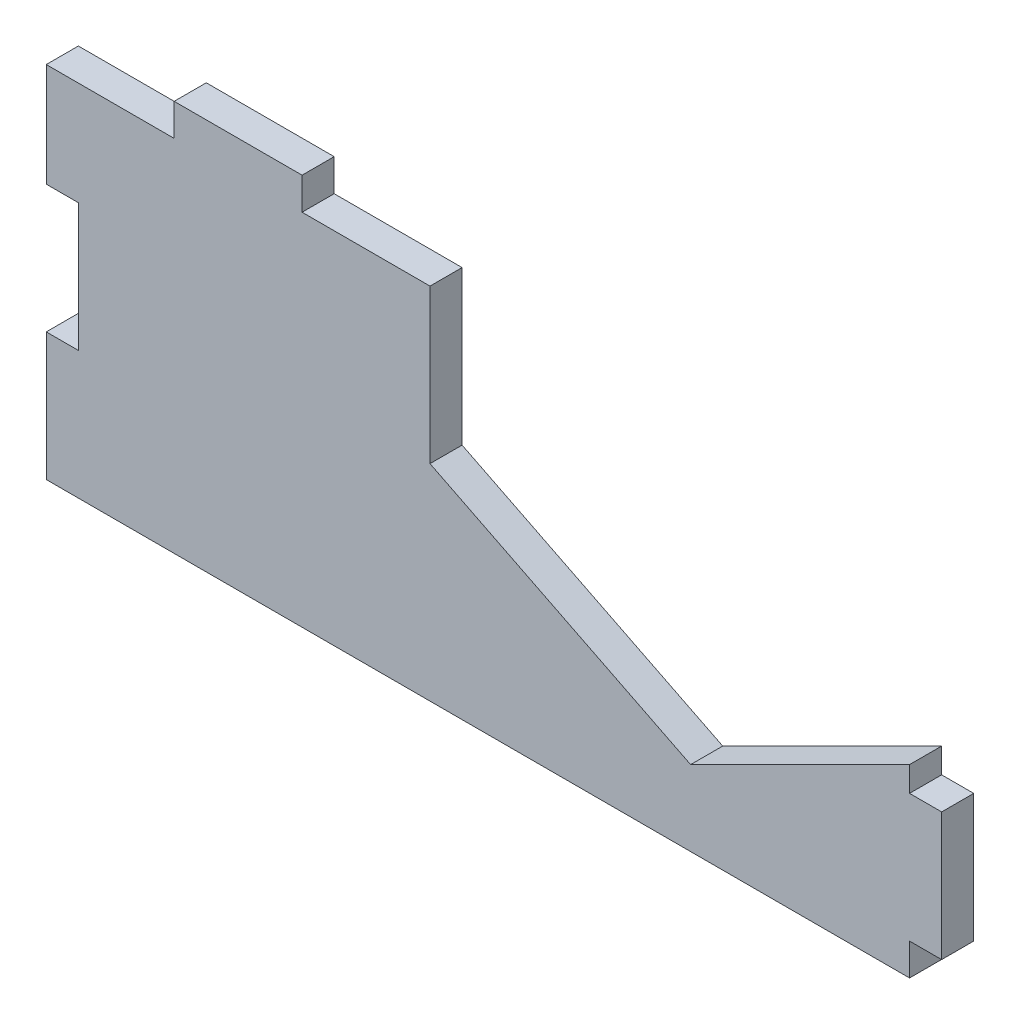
ISO-10303-21;
HEADER;
FILE_DESCRIPTION(('STEP AP214'),'2;1');
FILE_NAME('part.step','',(''),(''),'','','');
FILE_SCHEMA(('AUTOMOTIVE_DESIGN { 1 0 10303 214 1 1 1 1 }'));
ENDSEC;
DATA;
#1=APPLICATION_CONTEXT('core data for automotive mechanical design processes');
#2=APPLICATION_PROTOCOL_DEFINITION('international standard','automotive_design',2000,#1);
#3=PRODUCT_CONTEXT('',#1,'mechanical');
#4=PRODUCT('Part','Part','',(#3));
#5=PRODUCT_RELATED_PRODUCT_CATEGORY('part','',(#4));
#6=PRODUCT_DEFINITION_FORMATION('','',#4);
#7=PRODUCT_DEFINITION_CONTEXT('part definition',#1,'design');
#8=PRODUCT_DEFINITION('design','',#6,#7);
#9=PRODUCT_DEFINITION_SHAPE('','',#8);
#10=(LENGTH_UNIT() NAMED_UNIT(*) SI_UNIT(.MILLI.,.METRE.));
#11=(NAMED_UNIT(*) PLANE_ANGLE_UNIT() SI_UNIT($,.RADIAN.));
#12=(NAMED_UNIT(*) SI_UNIT($,.STERADIAN.) SOLID_ANGLE_UNIT());
#13=UNCERTAINTY_MEASURE_WITH_UNIT(LENGTH_MEASURE(1.E-05),#10,'distance_accuracy_value','');
#14=(GEOMETRIC_REPRESENTATION_CONTEXT(3) GLOBAL_UNCERTAINTY_ASSIGNED_CONTEXT((#13)) GLOBAL_UNIT_ASSIGNED_CONTEXT((#10,
#11,#12)) REPRESENTATION_CONTEXT('',''));
#15=CARTESIAN_POINT('',(0.,0.,0.));
#16=DIRECTION('',(0.,0.,1.));
#17=DIRECTION('',(1.,0.,0.));
#18=AXIS2_PLACEMENT_3D('',#15,#16,#17);
#19=CARTESIAN_POINT('',(-209.474072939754,246.209954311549,19.));
#20=DIRECTION('',(0.447213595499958,-0.894427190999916,0.));
#21=DIRECTION('',(0.894427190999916,0.447213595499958,0.));
#22=AXIS2_PLACEMENT_3D('',#19,#20,#21);
#23=PLANE('',#22);
#24=DIRECTION('',(-0.894427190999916,-0.447213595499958,0.));
#25=VECTOR('',#24,1.);
#26=CARTESIAN_POINT('',(-209.474072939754,246.209954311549,0.));
#27=LINE('',#26,#25);
#28=CARTESIAN_POINT('',(-79.8864762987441,311.003752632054,0.));
#29=VERTEX_POINT('',#28);
#30=CARTESIAN_POINT('',(-209.474072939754,246.209954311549,0.));
#31=VERTEX_POINT('',#30);
#32=EDGE_CURVE('E195',#29,#31,#27,.T.);
#33=ORIENTED_EDGE('',*,*,#32,.T.);
#34=DIRECTION('',(0.,0.,-1.));
#35=VECTOR('',#34,1.);
#36=CARTESIAN_POINT('',(-209.474072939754,246.209954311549,19.));
#37=LINE('',#36,#35);
#38=CARTESIAN_POINT('',(-209.474072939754,246.209954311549,19.));
#39=VERTEX_POINT('',#38);
#40=EDGE_CURVE('E11',#39,#31,#37,.T.);
#41=ORIENTED_EDGE('',*,*,#40,.F.);
#42=DIRECTION('',(-0.894427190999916,-0.447213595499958,0.));
#43=VECTOR('',#42,1.);
#44=CARTESIAN_POINT('',(-209.474072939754,246.209954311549,19.));
#45=LINE('',#44,#43);
#46=CARTESIAN_POINT('',(-79.8864762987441,311.003752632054,19.));
#47=VERTEX_POINT('',#46);
#48=EDGE_CURVE('E231',#47,#39,#45,.T.);
#49=ORIENTED_EDGE('',*,*,#48,.F.);
#50=DIRECTION('',(0.,0.,-1.));
#51=VECTOR('',#50,1.);
#52=CARTESIAN_POINT('',(-79.8864762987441,311.003752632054,19.));
#53=LINE('',#52,#51);
#54=EDGE_CURVE('E191',#47,#29,#53,.T.);
#55=ORIENTED_EDGE('',*,*,#54,.T.);
#56=EDGE_LOOP('',(#33,#41,#49,#55));
#57=FACE_BOUND('',#56,.T.);
#58=ADVANCED_FACE('F33',(#57),#23,.F.);
#59=CARTESIAN_POINT('',(-363.745021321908,323.345428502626,19.));
#60=DIRECTION('',(-0.447213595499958,-0.894427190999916,0.));
#61=DIRECTION('',(0.894427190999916,-0.447213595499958,0.));
#62=AXIS2_PLACEMENT_3D('',#59,#60,#61);
#63=PLANE('',#62);
#64=DIRECTION('',(-0.894427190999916,0.447213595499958,0.));
#65=VECTOR('',#64,1.);
#66=CARTESIAN_POINT('',(-363.745021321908,323.345428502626,0.));
#67=LINE('',#66,#65);
#68=CARTESIAN_POINT('',(-363.745021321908,323.345428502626,0.));
#69=VERTEX_POINT('',#68);
#70=EDGE_CURVE('E198',#31,#69,#67,.T.);
#71=ORIENTED_EDGE('',*,*,#70,.T.);
#72=DIRECTION('',(0.,0.,-1.));
#73=VECTOR('',#72,1.);
#74=CARTESIAN_POINT('',(-363.745021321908,323.345428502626,19.));
#75=LINE('',#74,#73);
#76=CARTESIAN_POINT('',(-363.745021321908,323.345428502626,19.));
#77=VERTEX_POINT('',#76);
#78=EDGE_CURVE('E41',#77,#69,#75,.T.);
#79=ORIENTED_EDGE('',*,*,#78,.F.);
#80=DIRECTION('',(-0.894427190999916,0.447213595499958,0.));
#81=VECTOR('',#80,1.);
#82=CARTESIAN_POINT('',(-363.745021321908,323.345428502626,19.));
#83=LINE('',#82,#81);
#84=EDGE_CURVE('E125',#39,#77,#83,.T.);
#85=ORIENTED_EDGE('',*,*,#84,.F.);
#86=ORIENTED_EDGE('',*,*,#40,.T.);
#87=EDGE_LOOP('',(#71,#79,#85,#86));
#88=FACE_BOUND('',#87,.T.);
#89=ADVANCED_FACE('F344',(#88),#63,.F.);
#90=CARTESIAN_POINT('',(-363.745021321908,414.365288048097,19.));
#91=DIRECTION('',(-1.,0.,0.));
#92=DIRECTION('',(0.,0.,1.));
#93=AXIS2_PLACEMENT_3D('',#90,#91,#92);
#94=PLANE('',#93);
#95=DIRECTION('',(0.,1.,0.));
#96=VECTOR('',#95,1.);
#97=CARTESIAN_POINT('',(-363.745021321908,414.365288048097,0.));
#98=LINE('',#97,#96);
#99=CARTESIAN_POINT('',(-363.745021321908,414.365288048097,0.));
#100=VERTEX_POINT('',#99);
#101=EDGE_CURVE('E200',#69,#100,#98,.T.);
#102=ORIENTED_EDGE('',*,*,#101,.T.);
#103=DIRECTION('',(0.,0.,-1.));
#104=VECTOR('',#103,1.);
#105=CARTESIAN_POINT('',(-363.745021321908,414.365288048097,19.));
#106=LINE('',#105,#104);
#107=CARTESIAN_POINT('',(-363.745021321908,414.365288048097,19.));
#108=VERTEX_POINT('',#107);
#109=EDGE_CURVE('E271',#108,#100,#106,.T.);
#110=ORIENTED_EDGE('',*,*,#109,.F.);
#111=DIRECTION('',(0.,1.,0.));
#112=VECTOR('',#111,1.);
#113=CARTESIAN_POINT('',(-363.745021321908,414.365288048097,19.));
#114=LINE('',#113,#112);
#115=EDGE_CURVE('E279',#77,#108,#114,.T.);
#116=ORIENTED_EDGE('',*,*,#115,.F.);
#117=ORIENTED_EDGE('',*,*,#78,.T.);
#118=EDGE_LOOP('',(#102,#110,#116,#117));
#119=FACE_BOUND('',#118,.T.);
#120=ADVANCED_FACE('F277',(#119),#94,.F.);
#121=CARTESIAN_POINT('',(-439.45883964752,414.365288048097,19.));
#122=DIRECTION('',(0.,-1.,0.));
#123=DIRECTION('',(0.,0.,-1.));
#124=AXIS2_PLACEMENT_3D('',#121,#122,#123);
#125=PLANE('',#124);
#126=DIRECTION('',(-1.,0.,0.));
#127=VECTOR('',#126,1.);
#128=CARTESIAN_POINT('',(-439.45883964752,414.365288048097,0.));
#129=LINE('',#128,#127);
#130=CARTESIAN_POINT('',(-439.45883964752,414.365288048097,0.));
#131=VERTEX_POINT('',#130);
#132=EDGE_CURVE('E202',#100,#131,#129,.T.);
#133=ORIENTED_EDGE('',*,*,#132,.T.);
#134=DIRECTION('',(0.,0.,-1.));
#135=VECTOR('',#134,1.);
#136=CARTESIAN_POINT('',(-439.45883964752,414.365288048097,19.));
#137=LINE('',#136,#135);
#138=CARTESIAN_POINT('',(-439.45883964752,414.365288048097,19.));
#139=VERTEX_POINT('',#138);
#140=EDGE_CURVE('E268',#139,#131,#137,.T.);
#141=ORIENTED_EDGE('',*,*,#140,.F.);
#142=DIRECTION('',(-1.,0.,0.));
#143=VECTOR('',#142,1.);
#144=CARTESIAN_POINT('',(-439.45883964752,414.365288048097,19.));
#145=LINE('',#144,#143);
#146=EDGE_CURVE('E297',#108,#139,#145,.T.);
#147=ORIENTED_EDGE('',*,*,#146,.F.);
#148=ORIENTED_EDGE('',*,*,#109,.T.);
#149=EDGE_LOOP('',(#133,#141,#147,#148));
#150=FACE_BOUND('',#149,.T.);
#151=ADVANCED_FACE('F288',(#150),#125,.F.);
#152=CARTESIAN_POINT('',(-439.45883964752,433.365288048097,19.));
#153=DIRECTION('',(-1.,0.,0.));
#154=DIRECTION('',(0.,0.,1.));
#155=AXIS2_PLACEMENT_3D('',#152,#153,#154);
#156=PLANE('',#155);
#157=DIRECTION('',(0.,1.,0.));
#158=VECTOR('',#157,1.);
#159=CARTESIAN_POINT('',(-439.45883964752,433.365288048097,0.));
#160=LINE('',#159,#158);
#161=CARTESIAN_POINT('',(-439.45883964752,433.365288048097,0.));
#162=VERTEX_POINT('',#161);
#163=EDGE_CURVE('E204',#131,#162,#160,.T.);
#164=ORIENTED_EDGE('',*,*,#163,.T.);
#165=DIRECTION('',(0.,0.,-1.));
#166=VECTOR('',#165,1.);
#167=CARTESIAN_POINT('',(-439.45883964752,433.365288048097,19.));
#168=LINE('',#167,#166);
#169=CARTESIAN_POINT('',(-439.45883964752,433.365288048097,19.));
#170=VERTEX_POINT('',#169);
#171=EDGE_CURVE('E265',#170,#162,#168,.T.);
#172=ORIENTED_EDGE('',*,*,#171,.F.);
#173=DIRECTION('',(0.,1.,0.));
#174=VECTOR('',#173,1.);
#175=CARTESIAN_POINT('',(-439.45883964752,433.365288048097,19.));
#176=LINE('',#175,#174);
#177=EDGE_CURVE('E294',#139,#170,#176,.T.);
#178=ORIENTED_EDGE('',*,*,#177,.F.);
#179=ORIENTED_EDGE('',*,*,#140,.T.);
#180=EDGE_LOOP('',(#164,#172,#178,#179));
#181=FACE_BOUND('',#180,.T.);
#182=ADVANCED_FACE('F292',(#181),#156,.F.);
#183=CARTESIAN_POINT('',(-515.172657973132,433.365288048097,19.));
#184=DIRECTION('',(0.,-1.,0.));
#185=DIRECTION('',(1.,0.,0.));
#186=AXIS2_PLACEMENT_3D('',#183,#184,#185);
#187=PLANE('',#186);
#188=DIRECTION('',(-1.,0.,0.));
#189=VECTOR('',#188,1.);
#190=CARTESIAN_POINT('',(-515.172657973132,433.365288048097,0.));
#191=LINE('',#190,#189);
#192=CARTESIAN_POINT('',(-515.172657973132,433.365288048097,0.));
#193=VERTEX_POINT('',#192);
#194=EDGE_CURVE('E206',#162,#193,#191,.T.);
#195=ORIENTED_EDGE('',*,*,#194,.T.);
#196=DIRECTION('',(0.,0.,-1.));
#197=VECTOR('',#196,1.);
#198=CARTESIAN_POINT('',(-515.172657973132,433.365288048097,19.));
#199=LINE('',#198,#197);
#200=CARTESIAN_POINT('',(-515.172657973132,433.365288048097,19.));
#201=VERTEX_POINT('',#200);
#202=EDGE_CURVE('E262',#201,#193,#199,.T.);
#203=ORIENTED_EDGE('',*,*,#202,.F.);
#204=DIRECTION('',(-1.,0.,0.));
#205=VECTOR('',#204,1.);
#206=CARTESIAN_POINT('',(-515.172657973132,433.365288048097,19.));
#207=LINE('',#206,#205);
#208=EDGE_CURVE('E296',#170,#201,#207,.T.);
#209=ORIENTED_EDGE('',*,*,#208,.F.);
#210=ORIENTED_EDGE('',*,*,#171,.T.);
#211=EDGE_LOOP('',(#195,#203,#209,#210));
#212=FACE_BOUND('',#211,.T.);
#213=ADVANCED_FACE('F357',(#212),#187,.F.);
#214=CARTESIAN_POINT('',(-515.172657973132,433.365288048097,19.));
#215=DIRECTION('',(1.,0.,0.));
#216=DIRECTION('',(0.,0.,-1.));
#217=AXIS2_PLACEMENT_3D('',#214,#215,#216);
#218=PLANE('',#217);
#219=DIRECTION('',(0.,-1.,0.));
#220=VECTOR('',#219,1.);
#221=CARTESIAN_POINT('',(-515.172657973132,433.365288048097,0.));
#222=LINE('',#221,#220);
#223=CARTESIAN_POINT('',(-515.172657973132,414.365288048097,0.));
#224=VERTEX_POINT('',#223);
#225=EDGE_CURVE('E208',#193,#224,#222,.T.);
#226=ORIENTED_EDGE('',*,*,#225,.T.);
#227=DIRECTION('',(0.,0.,-1.));
#228=VECTOR('',#227,1.);
#229=CARTESIAN_POINT('',(-515.172657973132,414.365288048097,19.));
#230=LINE('',#229,#228);
#231=CARTESIAN_POINT('',(-515.172657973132,414.365288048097,19.));
#232=VERTEX_POINT('',#231);
#233=EDGE_CURVE('E259',#232,#224,#230,.T.);
#234=ORIENTED_EDGE('',*,*,#233,.F.);
#235=DIRECTION('',(0.,-1.,0.));
#236=VECTOR('',#235,1.);
#237=CARTESIAN_POINT('',(-515.172657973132,433.365288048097,19.));
#238=LINE('',#237,#236);
#239=EDGE_CURVE('E299',#201,#232,#238,.T.);
#240=ORIENTED_EDGE('',*,*,#239,.F.);
#241=ORIENTED_EDGE('',*,*,#202,.T.);
#242=EDGE_LOOP('',(#226,#234,#240,#241));
#243=FACE_BOUND('',#242,.T.);
#244=ADVANCED_FACE('F360',(#243),#218,.F.);
#245=CARTESIAN_POINT('',(-590.886476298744,414.365288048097,19.));
#246=DIRECTION('',(0.,-1.,0.));
#247=DIRECTION('',(0.,0.,-1.));
#248=AXIS2_PLACEMENT_3D('',#245,#246,#247);
#249=PLANE('',#248);
#250=DIRECTION('',(-1.,0.,0.));
#251=VECTOR('',#250,1.);
#252=CARTESIAN_POINT('',(-590.886476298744,414.365288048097,0.));
#253=LINE('',#252,#251);
#254=CARTESIAN_POINT('',(-590.886476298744,414.365288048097,0.));
#255=VERTEX_POINT('',#254);
#256=EDGE_CURVE('E210',#224,#255,#253,.T.);
#257=ORIENTED_EDGE('',*,*,#256,.T.);
#258=DIRECTION('',(0.,0.,-1.));
#259=VECTOR('',#258,1.);
#260=CARTESIAN_POINT('',(-590.886476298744,414.365288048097,19.));
#261=LINE('',#260,#259);
#262=CARTESIAN_POINT('',(-590.886476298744,414.365288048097,19.));
#263=VERTEX_POINT('',#262);
#264=EDGE_CURVE('E256',#263,#255,#261,.T.);
#265=ORIENTED_EDGE('',*,*,#264,.F.);
#266=DIRECTION('',(-1.,0.,0.));
#267=VECTOR('',#266,1.);
#268=CARTESIAN_POINT('',(-590.886476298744,414.365288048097,19.));
#269=LINE('',#268,#267);
#270=EDGE_CURVE('E305',#232,#263,#269,.T.);
#271=ORIENTED_EDGE('',*,*,#270,.F.);
#272=ORIENTED_EDGE('',*,*,#233,.T.);
#273=EDGE_LOOP('',(#257,#265,#271,#272));
#274=FACE_BOUND('',#273,.T.);
#275=ADVANCED_FACE('F364',(#274),#249,.F.);
#276=CARTESIAN_POINT('',(-590.886476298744,414.365288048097,19.));
#277=DIRECTION('',(1.,0.,0.));
#278=DIRECTION('',(0.,0.,-1.));
#279=AXIS2_PLACEMENT_3D('',#276,#277,#278);
#280=PLANE('',#279);
#281=DIRECTION('',(0.,-1.,0.));
#282=VECTOR('',#281,1.);
#283=CARTESIAN_POINT('',(-590.886476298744,414.365288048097,0.));
#284=LINE('',#283,#282);
#285=CARTESIAN_POINT('',(-590.886476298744,353.036716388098,0.));
#286=VERTEX_POINT('',#285);
#287=EDGE_CURVE('E212',#255,#286,#284,.T.);
#288=ORIENTED_EDGE('',*,*,#287,.T.);
#289=DIRECTION('',(0.,0.,-1.));
#290=VECTOR('',#289,1.);
#291=CARTESIAN_POINT('',(-590.886476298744,353.036716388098,19.));
#292=LINE('',#291,#290);
#293=CARTESIAN_POINT('',(-590.886476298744,353.036716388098,19.));
#294=VERTEX_POINT('',#293);
#295=EDGE_CURVE('E253',#294,#286,#292,.T.);
#296=ORIENTED_EDGE('',*,*,#295,.F.);
#297=DIRECTION('',(0.,-1.,0.));
#298=VECTOR('',#297,1.);
#299=CARTESIAN_POINT('',(-590.886476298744,414.365288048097,19.));
#300=LINE('',#299,#298);
#301=EDGE_CURVE('E307',#263,#294,#300,.T.);
#302=ORIENTED_EDGE('',*,*,#301,.F.);
#303=ORIENTED_EDGE('',*,*,#264,.T.);
#304=EDGE_LOOP('',(#288,#296,#302,#303));
#305=FACE_BOUND('',#304,.T.);
#306=ADVANCED_FACE('F368',(#305),#280,.F.);
#307=CARTESIAN_POINT('',(-590.886476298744,353.036716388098,19.));
#308=DIRECTION('',(0.,1.,0.));
#309=DIRECTION('',(0.,0.,1.));
#310=AXIS2_PLACEMENT_3D('',#307,#308,#309);
#311=PLANE('',#310);
#312=DIRECTION('',(1.,0.,0.));
#313=VECTOR('',#312,1.);
#314=CARTESIAN_POINT('',(-590.886476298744,353.036716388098,0.));
#315=LINE('',#314,#313);
#316=CARTESIAN_POINT('',(-571.886476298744,353.036716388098,0.));
#317=VERTEX_POINT('',#316);
#318=EDGE_CURVE('E214',#286,#317,#315,.T.);
#319=ORIENTED_EDGE('',*,*,#318,.T.);
#320=DIRECTION('',(0.,0.,-1.));
#321=VECTOR('',#320,1.);
#322=CARTESIAN_POINT('',(-571.886476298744,353.036716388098,19.));
#323=LINE('',#322,#321);
#324=CARTESIAN_POINT('',(-571.886476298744,353.036716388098,19.));
#325=VERTEX_POINT('',#324);
#326=EDGE_CURVE('E250',#325,#317,#323,.T.);
#327=ORIENTED_EDGE('',*,*,#326,.F.);
#328=DIRECTION('',(1.,0.,0.));
#329=VECTOR('',#328,1.);
#330=CARTESIAN_POINT('',(-590.886476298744,353.036716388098,19.));
#331=LINE('',#330,#329);
#332=EDGE_CURVE('E309',#294,#325,#331,.T.);
#333=ORIENTED_EDGE('',*,*,#332,.F.);
#334=ORIENTED_EDGE('',*,*,#295,.T.);
#335=EDGE_LOOP('',(#319,#327,#333,#334));
#336=FACE_BOUND('',#335,.T.);
#337=ADVANCED_FACE('F372',(#336),#311,.F.);
#338=CARTESIAN_POINT('',(-571.886476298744,353.036716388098,19.));
#339=DIRECTION('',(1.,0.,0.));
#340=DIRECTION('',(0.,1.,0.));
#341=AXIS2_PLACEMENT_3D('',#338,#339,#340);
#342=PLANE('',#341);
#343=DIRECTION('',(0.,-1.,0.));
#344=VECTOR('',#343,1.);
#345=CARTESIAN_POINT('',(-571.886476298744,353.036716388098,0.));
#346=LINE('',#345,#344);
#347=CARTESIAN_POINT('',(-571.886476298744,277.322898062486,0.));
#348=VERTEX_POINT('',#347);
#349=EDGE_CURVE('E216',#317,#348,#346,.T.);
#350=ORIENTED_EDGE('',*,*,#349,.T.);
#351=DIRECTION('',(0.,0.,-1.));
#352=VECTOR('',#351,1.);
#353=CARTESIAN_POINT('',(-571.886476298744,277.322898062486,19.));
#354=LINE('',#353,#352);
#355=CARTESIAN_POINT('',(-571.886476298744,277.322898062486,19.));
#356=VERTEX_POINT('',#355);
#357=EDGE_CURVE('E247',#356,#348,#354,.T.);
#358=ORIENTED_EDGE('',*,*,#357,.F.);
#359=DIRECTION('',(0.,-1.,0.));
#360=VECTOR('',#359,1.);
#361=CARTESIAN_POINT('',(-571.886476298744,353.036716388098,19.));
#362=LINE('',#361,#360);
#363=EDGE_CURVE('E311',#325,#356,#362,.T.);
#364=ORIENTED_EDGE('',*,*,#363,.F.);
#365=ORIENTED_EDGE('',*,*,#326,.T.);
#366=EDGE_LOOP('',(#350,#358,#364,#365));
#367=FACE_BOUND('',#366,.T.);
#368=ADVANCED_FACE('F376',(#367),#342,.F.);
#369=CARTESIAN_POINT('',(-590.886476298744,277.322898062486,19.));
#370=DIRECTION('',(0.,-1.,0.));
#371=DIRECTION('',(0.,0.,-1.));
#372=AXIS2_PLACEMENT_3D('',#369,#370,#371);
#373=PLANE('',#372);
#374=DIRECTION('',(-1.,0.,0.));
#375=VECTOR('',#374,1.);
#376=CARTESIAN_POINT('',(-590.886476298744,277.322898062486,0.));
#377=LINE('',#376,#375);
#378=CARTESIAN_POINT('',(-590.886476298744,277.322898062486,0.));
#379=VERTEX_POINT('',#378);
#380=EDGE_CURVE('E218',#348,#379,#377,.T.);
#381=ORIENTED_EDGE('',*,*,#380,.T.);
#382=DIRECTION('',(0.,0.,-1.));
#383=VECTOR('',#382,1.);
#384=CARTESIAN_POINT('',(-590.886476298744,277.322898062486,19.));
#385=LINE('',#384,#383);
#386=CARTESIAN_POINT('',(-590.886476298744,277.322898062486,19.));
#387=VERTEX_POINT('',#386);
#388=EDGE_CURVE('E244',#387,#379,#385,.T.);
#389=ORIENTED_EDGE('',*,*,#388,.F.);
#390=DIRECTION('',(-1.,0.,0.));
#391=VECTOR('',#390,1.);
#392=CARTESIAN_POINT('',(-590.886476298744,277.322898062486,19.));
#393=LINE('',#392,#391);
#394=EDGE_CURVE('E313',#356,#387,#393,.T.);
#395=ORIENTED_EDGE('',*,*,#394,.F.);
#396=ORIENTED_EDGE('',*,*,#357,.T.);
#397=EDGE_LOOP('',(#381,#389,#395,#396));
#398=FACE_BOUND('',#397,.T.);
#399=ADVANCED_FACE('F380',(#398),#373,.F.);
#400=CARTESIAN_POINT('',(-590.886476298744,277.322898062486,19.));
#401=DIRECTION('',(1.,0.,0.));
#402=DIRECTION('',(0.,0.,-1.));
#403=AXIS2_PLACEMENT_3D('',#400,#401,#402);
#404=PLANE('',#403);
#405=DIRECTION('',(0.,-1.,0.));
#406=VECTOR('',#405,1.);
#407=CARTESIAN_POINT('',(-590.886476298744,277.322898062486,0.));
#408=LINE('',#407,#406);
#409=CARTESIAN_POINT('',(-590.886476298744,201.609079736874,0.));
#410=VERTEX_POINT('',#409);
#411=EDGE_CURVE('E220',#379,#410,#408,.T.);
#412=ORIENTED_EDGE('',*,*,#411,.T.);
#413=DIRECTION('',(0.,0.,-1.));
#414=VECTOR('',#413,1.);
#415=CARTESIAN_POINT('',(-590.886476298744,201.609079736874,19.));
#416=LINE('',#415,#414);
#417=CARTESIAN_POINT('',(-590.886476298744,201.609079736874,19.));
#418=VERTEX_POINT('',#417);
#419=EDGE_CURVE('E241',#418,#410,#416,.T.);
#420=ORIENTED_EDGE('',*,*,#419,.F.);
#421=DIRECTION('',(0.,-1.,0.));
#422=VECTOR('',#421,1.);
#423=CARTESIAN_POINT('',(-590.886476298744,277.322898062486,19.));
#424=LINE('',#423,#422);
#425=EDGE_CURVE('E315',#387,#418,#424,.T.);
#426=ORIENTED_EDGE('',*,*,#425,.F.);
#427=ORIENTED_EDGE('',*,*,#388,.T.);
#428=EDGE_LOOP('',(#412,#420,#426,#427));
#429=FACE_BOUND('',#428,.T.);
#430=ADVANCED_FACE('F384',(#429),#404,.F.);
#431=CARTESIAN_POINT('',(-590.886476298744,201.609079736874,19.));
#432=DIRECTION('',(0.,1.,0.));
#433=DIRECTION('',(0.,0.,1.));
#434=AXIS2_PLACEMENT_3D('',#431,#432,#433);
#435=PLANE('',#434);
#436=DIRECTION('',(1.,0.,0.));
#437=VECTOR('',#436,1.);
#438=CARTESIAN_POINT('',(-590.886476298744,201.609079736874,0.));
#439=LINE('',#438,#437);
#440=CARTESIAN_POINT('',(-79.886476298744,201.609079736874,0.));
#441=VERTEX_POINT('',#440);
#442=EDGE_CURVE('E222',#410,#441,#439,.T.);
#443=ORIENTED_EDGE('',*,*,#442,.T.);
#444=DIRECTION('',(0.,0.,-1.));
#445=VECTOR('',#444,1.);
#446=CARTESIAN_POINT('',(-79.886476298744,201.609079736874,19.));
#447=LINE('',#446,#445);
#448=CARTESIAN_POINT('',(-79.886476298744,201.609079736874,19.));
#449=VERTEX_POINT('',#448);
#450=EDGE_CURVE('E238',#449,#441,#447,.T.);
#451=ORIENTED_EDGE('',*,*,#450,.F.);
#452=DIRECTION('',(1.,0.,0.));
#453=VECTOR('',#452,1.);
#454=CARTESIAN_POINT('',(-590.886476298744,201.609079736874,19.));
#455=LINE('',#454,#453);
#456=EDGE_CURVE('E317',#418,#449,#455,.T.);
#457=ORIENTED_EDGE('',*,*,#456,.F.);
#458=ORIENTED_EDGE('',*,*,#419,.T.);
#459=EDGE_LOOP('',(#443,#451,#457,#458));
#460=FACE_BOUND('',#459,.T.);
#461=ADVANCED_FACE('F388',(#460),#435,.F.);
#462=CARTESIAN_POINT('',(-79.8864762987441,220.537183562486,19.));
#463=DIRECTION('',(-1.,0.,0.));
#464=DIRECTION('',(0.,-1.,0.));
#465=AXIS2_PLACEMENT_3D('',#462,#463,#464);
#466=PLANE('',#465);
#467=DIRECTION('',(0.,1.,0.));
#468=VECTOR('',#467,1.);
#469=CARTESIAN_POINT('',(-79.8864762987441,220.537183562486,0.));
#470=LINE('',#469,#468);
#471=CARTESIAN_POINT('',(-79.8864762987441,220.537183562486,0.));
#472=VERTEX_POINT('',#471);
#473=EDGE_CURVE('E224',#441,#472,#470,.T.);
#474=ORIENTED_EDGE('',*,*,#473,.T.);
#475=DIRECTION('',(0.,0.,-1.));
#476=VECTOR('',#475,1.);
#477=CARTESIAN_POINT('',(-79.8864762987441,220.537183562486,19.));
#478=LINE('',#477,#476);
#479=CARTESIAN_POINT('',(-79.8864762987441,220.537183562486,19.));
#480=VERTEX_POINT('',#479);
#481=EDGE_CURVE('E235',#480,#472,#478,.T.);
#482=ORIENTED_EDGE('',*,*,#481,.F.);
#483=DIRECTION('',(0.,1.,0.));
#484=VECTOR('',#483,1.);
#485=CARTESIAN_POINT('',(-79.8864762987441,220.537183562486,19.));
#486=LINE('',#485,#484);
#487=EDGE_CURVE('E319',#449,#480,#486,.T.);
#488=ORIENTED_EDGE('',*,*,#487,.F.);
#489=ORIENTED_EDGE('',*,*,#450,.T.);
#490=EDGE_LOOP('',(#474,#482,#488,#489));
#491=FACE_BOUND('',#490,.T.);
#492=ADVANCED_FACE('F325',(#491),#466,.F.);
#493=CARTESIAN_POINT('',(-79.8864762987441,220.537183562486,19.));
#494=DIRECTION('',(0.,1.,0.));
#495=DIRECTION('',(0.,0.,1.));
#496=AXIS2_PLACEMENT_3D('',#493,#494,#495);
#497=PLANE('',#496);
#498=DIRECTION('',(1.,0.,0.));
#499=VECTOR('',#498,1.);
#500=CARTESIAN_POINT('',(-79.8864762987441,220.537183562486,0.));
#501=LINE('',#500,#499);
#502=CARTESIAN_POINT('',(-60.8864762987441,220.537183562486,0.));
#503=VERTEX_POINT('',#502);
#504=EDGE_CURVE('E226',#472,#503,#501,.T.);
#505=ORIENTED_EDGE('',*,*,#504,.T.);
#506=DIRECTION('',(0.,0.,-1.));
#507=VECTOR('',#506,1.);
#508=CARTESIAN_POINT('',(-60.8864762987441,220.537183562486,19.));
#509=LINE('',#508,#507);
#510=CARTESIAN_POINT('',(-60.8864762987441,220.537183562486,19.));
#511=VERTEX_POINT('',#510);
#512=EDGE_CURVE('E186',#511,#503,#509,.T.);
#513=ORIENTED_EDGE('',*,*,#512,.F.);
#514=DIRECTION('',(1.,0.,0.));
#515=VECTOR('',#514,1.);
#516=CARTESIAN_POINT('',(-79.8864762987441,220.537183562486,19.));
#517=LINE('',#516,#515);
#518=EDGE_CURVE('E177',#480,#511,#517,.T.);
#519=ORIENTED_EDGE('',*,*,#518,.F.);
#520=ORIENTED_EDGE('',*,*,#481,.T.);
#521=EDGE_LOOP('',(#505,#513,#519,#520));
#522=FACE_BOUND('',#521,.T.);
#523=ADVANCED_FACE('F329',(#522),#497,.F.);
#524=CARTESIAN_POINT('',(-60.8864762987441,296.251001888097,19.));
#525=DIRECTION('',(-1.,0.,0.));
#526=DIRECTION('',(0.,-1.,0.));
#527=AXIS2_PLACEMENT_3D('',#524,#525,#526);
#528=PLANE('',#527);
#529=DIRECTION('',(0.,1.,0.));
#530=VECTOR('',#529,1.);
#531=CARTESIAN_POINT('',(-60.8864762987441,296.251001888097,0.));
#532=LINE('',#531,#530);
#533=CARTESIAN_POINT('',(-60.8864762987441,296.251001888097,0.));
#534=VERTEX_POINT('',#533);
#535=EDGE_CURVE('E185',#503,#534,#532,.T.);
#536=ORIENTED_EDGE('',*,*,#535,.T.);
#537=DIRECTION('',(0.,0.,-1.));
#538=VECTOR('',#537,1.);
#539=CARTESIAN_POINT('',(-60.8864762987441,296.251001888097,19.));
#540=LINE('',#539,#538);
#541=CARTESIAN_POINT('',(-60.8864762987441,296.251001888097,19.));
#542=VERTEX_POINT('',#541);
#543=EDGE_CURVE('E182',#542,#534,#540,.T.);
#544=ORIENTED_EDGE('',*,*,#543,.F.);
#545=DIRECTION('',(0.,1.,0.));
#546=VECTOR('',#545,1.);
#547=CARTESIAN_POINT('',(-60.8864762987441,296.251001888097,19.));
#548=LINE('',#547,#546);
#549=EDGE_CURVE('E171',#511,#542,#548,.T.);
#550=ORIENTED_EDGE('',*,*,#549,.F.);
#551=ORIENTED_EDGE('',*,*,#512,.T.);
#552=EDGE_LOOP('',(#536,#544,#550,#551));
#553=FACE_BOUND('',#552,.T.);
#554=ADVANCED_FACE('F183',(#553),#528,.F.);
#555=CARTESIAN_POINT('',(-79.8864762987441,296.251001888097,19.));
#556=DIRECTION('',(0.,-1.,0.));
#557=DIRECTION('',(0.,0.,-1.));
#558=AXIS2_PLACEMENT_3D('',#555,#556,#557);
#559=PLANE('',#558);
#560=DIRECTION('',(-1.,0.,0.));
#561=VECTOR('',#560,1.);
#562=CARTESIAN_POINT('',(-79.8864762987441,296.251001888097,0.));
#563=LINE('',#562,#561);
#564=CARTESIAN_POINT('',(-79.8864762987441,296.251001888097,0.));
#565=VERTEX_POINT('',#564);
#566=EDGE_CURVE('E111',#534,#565,#563,.T.);
#567=ORIENTED_EDGE('',*,*,#566,.T.);
#568=DIRECTION('',(0.,0.,-1.));
#569=VECTOR('',#568,1.);
#570=CARTESIAN_POINT('',(-79.8864762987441,296.251001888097,19.));
#571=LINE('',#570,#569);
#572=CARTESIAN_POINT('',(-79.8864762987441,296.251001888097,19.));
#573=VERTEX_POINT('',#572);
#574=EDGE_CURVE('E187',#573,#565,#571,.T.);
#575=ORIENTED_EDGE('',*,*,#574,.F.);
#576=DIRECTION('',(-1.,0.,0.));
#577=VECTOR('',#576,1.);
#578=CARTESIAN_POINT('',(-79.8864762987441,296.251001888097,19.));
#579=LINE('',#578,#577);
#580=EDGE_CURVE('E175',#542,#573,#579,.T.);
#581=ORIENTED_EDGE('',*,*,#580,.F.);
#582=ORIENTED_EDGE('',*,*,#543,.T.);
#583=EDGE_LOOP('',(#567,#575,#581,#582));
#584=FACE_BOUND('',#583,.T.);
#585=ADVANCED_FACE('F189',(#584),#559,.F.);
#586=CARTESIAN_POINT('',(-79.8864762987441,311.003752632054,19.));
#587=DIRECTION('',(-1.,0.,0.));
#588=DIRECTION('',(0.,0.,1.));
#589=AXIS2_PLACEMENT_3D('',#586,#587,#588);
#590=PLANE('',#589);
#591=DIRECTION('',(0.,1.,0.));
#592=VECTOR('',#591,1.);
#593=CARTESIAN_POINT('',(-79.8864762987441,311.003752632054,0.));
#594=LINE('',#593,#592);
#595=EDGE_CURVE('E117',#565,#29,#594,.T.);
#596=ORIENTED_EDGE('',*,*,#595,.T.);
#597=ORIENTED_EDGE('',*,*,#54,.F.);
#598=DIRECTION('',(0.,1.,0.));
#599=VECTOR('',#598,1.);
#600=CARTESIAN_POINT('',(-79.8864762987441,311.003752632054,19.));
#601=LINE('',#600,#599);
#602=EDGE_CURVE('E49',#573,#47,#601,.T.);
#603=ORIENTED_EDGE('',*,*,#602,.F.);
#604=ORIENTED_EDGE('',*,*,#574,.T.);
#605=EDGE_LOOP('',(#596,#597,#603,#604));
#606=FACE_BOUND('',#605,.T.);
#607=ADVANCED_FACE('F333',(#606),#590,.F.);
#608=CARTESIAN_POINT('',(0.,0.,19.));
#609=DIRECTION('',(0.,0.,-1.));
#610=DIRECTION('',(-1.,0.,0.));
#611=AXIS2_PLACEMENT_3D('',#608,#609,#610);
#612=PLANE('',#611);
#613=ORIENTED_EDGE('',*,*,#48,.T.);
#614=ORIENTED_EDGE('',*,*,#84,.T.);
#615=ORIENTED_EDGE('',*,*,#115,.T.);
#616=ORIENTED_EDGE('',*,*,#146,.T.);
#617=ORIENTED_EDGE('',*,*,#177,.T.);
#618=ORIENTED_EDGE('',*,*,#208,.T.);
#619=ORIENTED_EDGE('',*,*,#239,.T.);
#620=ORIENTED_EDGE('',*,*,#270,.T.);
#621=ORIENTED_EDGE('',*,*,#301,.T.);
#622=ORIENTED_EDGE('',*,*,#332,.T.);
#623=ORIENTED_EDGE('',*,*,#363,.T.);
#624=ORIENTED_EDGE('',*,*,#394,.T.);
#625=ORIENTED_EDGE('',*,*,#425,.T.);
#626=ORIENTED_EDGE('',*,*,#456,.T.);
#627=ORIENTED_EDGE('',*,*,#487,.T.);
#628=ORIENTED_EDGE('',*,*,#518,.T.);
#629=ORIENTED_EDGE('',*,*,#549,.T.);
#630=ORIENTED_EDGE('',*,*,#580,.T.);
#631=ORIENTED_EDGE('',*,*,#602,.T.);
#632=EDGE_LOOP('',(#613,#614,#615,#616,#617,#618,#619,#620,#621,#622,#623,#624,#625,#626,#627,
#628,#629,#630,#631));
#633=FACE_BOUND('',#632,.T.);
#634=ADVANCED_FACE('F173',(#633),#612,.F.);
#635=CARTESIAN_POINT('',(0.,0.,0.));
#636=DIRECTION('',(0.,0.,-1.));
#637=DIRECTION('',(-1.,0.,0.));
#638=AXIS2_PLACEMENT_3D('',#635,#636,#637);
#639=PLANE('',#638);
#640=ORIENTED_EDGE('',*,*,#32,.F.);
#641=ORIENTED_EDGE('',*,*,#595,.F.);
#642=ORIENTED_EDGE('',*,*,#566,.F.);
#643=ORIENTED_EDGE('',*,*,#535,.F.);
#644=ORIENTED_EDGE('',*,*,#504,.F.);
#645=ORIENTED_EDGE('',*,*,#473,.F.);
#646=ORIENTED_EDGE('',*,*,#442,.F.);
#647=ORIENTED_EDGE('',*,*,#411,.F.);
#648=ORIENTED_EDGE('',*,*,#380,.F.);
#649=ORIENTED_EDGE('',*,*,#349,.F.);
#650=ORIENTED_EDGE('',*,*,#318,.F.);
#651=ORIENTED_EDGE('',*,*,#287,.F.);
#652=ORIENTED_EDGE('',*,*,#256,.F.);
#653=ORIENTED_EDGE('',*,*,#225,.F.);
#654=ORIENTED_EDGE('',*,*,#194,.F.);
#655=ORIENTED_EDGE('',*,*,#163,.F.);
#656=ORIENTED_EDGE('',*,*,#132,.F.);
#657=ORIENTED_EDGE('',*,*,#101,.F.);
#658=ORIENTED_EDGE('',*,*,#70,.F.);
#659=EDGE_LOOP('',(#640,#641,#642,#643,#644,#645,#646,#647,#648,#649,#650,#651,#652,#653,#654,
#655,#656,#657,#658));
#660=FACE_BOUND('',#659,.T.);
#661=ADVANCED_FACE('F283',(#660),#639,.T.);
#662=CLOSED_SHELL('',(#58,#89,#120,#151,#182,#213,#244,#275,#306,#337,#368,#399,#430,#461,#492,
#523,#554,#585,#607,#634,#661));
#663=MANIFOLD_SOLID_BREP('B2',#662);
#664=ADVANCED_BREP_SHAPE_REPRESENTATION('',(#18,#663),#14);
#665=SHAPE_DEFINITION_REPRESENTATION(#9,#664);
ENDSEC;
END-ISO-10303-21;
